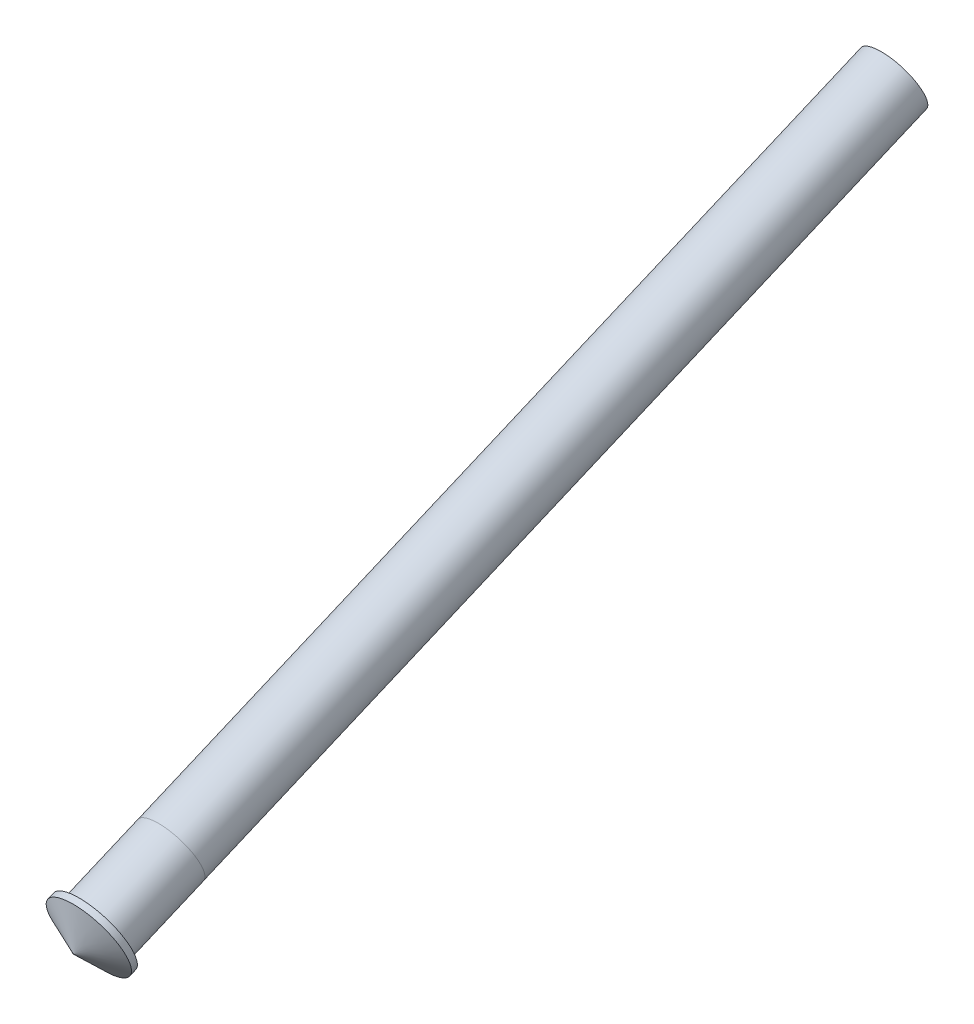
ISO-10303-21;
HEADER;
FILE_DESCRIPTION(('STEP AP214'),'2;1');
FILE_NAME('part.step','',(''),(''),'','','');
FILE_SCHEMA(('AUTOMOTIVE_DESIGN { 1 0 10303 214 1 1 1 1 }'));
ENDSEC;
DATA;
#1=APPLICATION_CONTEXT('core data for automotive mechanical design processes');
#2=APPLICATION_PROTOCOL_DEFINITION('international standard','automotive_design',2000,#1);
#3=PRODUCT_CONTEXT('',#1,'mechanical');
#4=PRODUCT('Part','Part','',(#3));
#5=PRODUCT_RELATED_PRODUCT_CATEGORY('part','',(#4));
#6=PRODUCT_DEFINITION_FORMATION('','',#4);
#7=PRODUCT_DEFINITION_CONTEXT('part definition',#1,'design');
#8=PRODUCT_DEFINITION('design','',#6,#7);
#9=PRODUCT_DEFINITION_SHAPE('','',#8);
#10=(LENGTH_UNIT() NAMED_UNIT(*) SI_UNIT(.MILLI.,.METRE.));
#11=(NAMED_UNIT(*) PLANE_ANGLE_UNIT() SI_UNIT($,.RADIAN.));
#12=(NAMED_UNIT(*) SI_UNIT($,.STERADIAN.) SOLID_ANGLE_UNIT());
#13=UNCERTAINTY_MEASURE_WITH_UNIT(LENGTH_MEASURE(1.E-05),#10,'distance_accuracy_value','');
#14=(GEOMETRIC_REPRESENTATION_CONTEXT(3) GLOBAL_UNCERTAINTY_ASSIGNED_CONTEXT((#13)) GLOBAL_UNIT_ASSIGNED_CONTEXT((#10,
#11,#12)) REPRESENTATION_CONTEXT('',''));
#15=CARTESIAN_POINT('',(0.,0.,0.));
#16=DIRECTION('',(0.,0.,1.));
#17=DIRECTION('',(1.,0.,0.));
#18=AXIS2_PLACEMENT_3D('',#15,#16,#17);
#19=CARTESIAN_POINT('',(0.,19.3504227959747,2.8839953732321));
#20=DIRECTION('',(0.,-0.390731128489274,0.92050485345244));
#21=DIRECTION('',(0.,-0.92050485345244,-0.390731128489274));
#22=AXIS2_PLACEMENT_3D('',#19,#20,#21);
#23=CYLINDRICAL_SURFACE('',#22,6.35);
#24=CARTESIAN_POINT('',(0.,19.3504227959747,2.8839953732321));
#25=DIRECTION('',(0.,-0.390731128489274,0.920504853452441));
#26=DIRECTION('',(-1.,0.,0.));
#27=AXIS2_PLACEMENT_3D('',#24,#25,#26);
#28=CIRCLE('',#27,6.35);
#29=CARTESIAN_POINT('',(-6.35,19.3504227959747,2.8839953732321));
#30=VERTEX_POINT('',#29);
#31=EDGE_CURVE('E45',#30,#30,#28,.T.);
#32=ORIENTED_EDGE('',*,*,#31,.T.);
#33=EDGE_LOOP('',(#32));
#34=FACE_BOUND('',#33,.T.);
#35=CARTESIAN_POINT('',(0.,12.8994518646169,18.0815305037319));
#36=DIRECTION('',(0.,-0.390731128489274,0.920504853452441));
#37=DIRECTION('',(0.,-0.92050485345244,-0.390731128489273));
#38=AXIS2_PLACEMENT_3D('',#35,#36,#37);
#39=CIRCLE('',#38,6.35);
#40=CARTESIAN_POINT('',(0.,7.05424604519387,15.600387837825));
#41=VERTEX_POINT('',#40);
#42=EDGE_CURVE('E41',#41,#41,#39,.F.);
#43=ORIENTED_EDGE('',*,*,#42,.T.);
#44=EDGE_LOOP('',(#43));
#45=FACE_BOUND('',#44,.T.);
#46=ADVANCED_FACE('F37',(#34,#45),#23,.T.);
#47=CARTESIAN_POINT('',(0.,43.2090906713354,-53.3235037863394));
#48=DIRECTION('',(0.,-0.390731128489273,0.92050485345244));
#49=DIRECTION('',(0.,-0.92050485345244,-0.390731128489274));
#50=AXIS2_PLACEMENT_3D('',#47,#48,#49);
#51=CYLINDRICAL_SURFACE('',#50,6.3373);
#52=CARTESIAN_POINT('',(0.,19.3504227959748,2.88399537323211));
#53=DIRECTION('',(0.,-0.390731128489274,0.920504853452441));
#54=DIRECTION('',(0.,-0.92050485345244,-0.390731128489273));
#55=AXIS2_PLACEMENT_3D('',#52,#53,#54);
#56=CIRCLE('',#55,6.3373);
#57=CARTESIAN_POINT('',(0.,13.5169073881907,0.407814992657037));
#58=VERTEX_POINT('',#57);
#59=EDGE_CURVE('E10',#58,#58,#56,.F.);
#60=ORIENTED_EDGE('',*,*,#59,.T.);
#61=EDGE_LOOP('',(#60));
#62=FACE_BOUND('',#61,.T.);
#63=CARTESIAN_POINT('',(0.,80.5686643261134,-141.337143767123));
#64=DIRECTION('',(0.,0.390731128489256,-0.920504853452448));
#65=DIRECTION('',(0.,0.920504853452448,0.390731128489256));
#66=AXIS2_PLACEMENT_3D('',#63,#64,#65);
#67=CIRCLE('',#66,6.33730000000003);
#68=CARTESIAN_POINT('',(0.,86.4021797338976,-138.860963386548));
#69=VERTEX_POINT('',#68);
#70=EDGE_CURVE('E60',#69,#69,#67,.T.);
#71=ORIENTED_EDGE('',*,*,#70,.F.);
#72=EDGE_LOOP('',(#71));
#73=FACE_BOUND('',#72,.T.);
#74=ADVANCED_FACE('F39',(#62,#73),#51,.T.);
#75=CARTESIAN_POINT('',(0.,19.3504227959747,2.8839953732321));
#76=DIRECTION('',(0.,-0.390731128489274,0.920504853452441));
#77=DIRECTION('',(0.,-0.92050485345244,-0.390731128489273));
#78=AXIS2_PLACEMENT_3D('',#75,#76,#77);
#79=PLANE('',#78);
#80=ORIENTED_EDGE('',*,*,#59,.F.);
#81=EDGE_LOOP('',(#80));
#82=FACE_BOUND('',#81,.T.);
#83=ORIENTED_EDGE('',*,*,#31,.F.);
#84=EDGE_LOOP('',(#83));
#85=FACE_BOUND('',#84,.T.);
#86=ADVANCED_FACE('F67',(#82,#85),#79,.F.);
#87=CARTESIAN_POINT('',(0.,12.8994518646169,18.0815305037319));
#88=DIRECTION('',(0.,-0.390731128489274,0.92050485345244));
#89=DIRECTION('',(0.,-0.92050485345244,-0.390731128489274));
#90=AXIS2_PLACEMENT_3D('',#87,#88,#89);
#91=CYLINDRICAL_SURFACE('',#90,7.9375);
#92=CARTESIAN_POINT('',(0.,12.8994518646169,18.0815305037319));
#93=DIRECTION('',(0.,-0.390731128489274,0.920504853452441));
#94=DIRECTION('',(-1.,0.,0.));
#95=AXIS2_PLACEMENT_3D('',#92,#93,#94);
#96=CIRCLE('',#95,7.9375);
#97=CARTESIAN_POINT('',(-7.9375,12.8994518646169,18.0815305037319));
#98=VERTEX_POINT('',#97);
#99=EDGE_CURVE('E51',#98,#98,#96,.T.);
#100=ORIENTED_EDGE('',*,*,#99,.T.);
#101=EDGE_LOOP('',(#100));
#102=FACE_BOUND('',#101,.T.);
#103=CARTESIAN_POINT('',(0.,12.4032233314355,19.2505716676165));
#104=DIRECTION('',(0.,-0.390731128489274,0.920504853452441));
#105=DIRECTION('',(-1.,0.,0.));
#106=AXIS2_PLACEMENT_3D('',#103,#104,#105);
#107=CIRCLE('',#106,7.9375);
#108=CARTESIAN_POINT('',(0.,5.09671605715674,16.1491433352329));
#109=VERTEX_POINT('',#108);
#110=EDGE_CURVE('E54',#109,#109,#107,.T.);
#111=ORIENTED_EDGE('',*,*,#110,.F.);
#112=EDGE_LOOP('',(#111));
#113=FACE_BOUND('',#112,.T.);
#114=ADVANCED_FACE('F73',(#102,#113),#91,.T.);
#115=CARTESIAN_POINT('',(0.,12.8994518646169,18.0815305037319));
#116=DIRECTION('',(0.,-0.390731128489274,0.920504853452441));
#117=DIRECTION('',(0.,-0.92050485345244,-0.390731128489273));
#118=AXIS2_PLACEMENT_3D('',#115,#116,#117);
#119=PLANE('',#118);
#120=ORIENTED_EDGE('',*,*,#42,.F.);
#121=EDGE_LOOP('',(#120));
#122=FACE_BOUND('',#121,.T.);
#123=ORIENTED_EDGE('',*,*,#99,.F.);
#124=EDGE_LOOP('',(#123));
#125=FACE_BOUND('',#124,.T.);
#126=ADVANCED_FACE('F87',(#122,#125),#119,.F.);
#127=CARTESIAN_POINT('',(0.,12.4032233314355,19.2505716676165));
#128=DIRECTION('',(0.,0.390731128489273,-0.92050485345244));
#129=DIRECTION('',(0.,-0.92050485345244,-0.390731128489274));
#130=AXIS2_PLACEMENT_3D('',#127,#128,#129);
#131=CONICAL_SURFACE('',#130,7.9375,1.1693705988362);
#132=CARTESIAN_POINT('',(0.,11.0966696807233,22.3286191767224));
#133=DIRECTION('',(0.,-0.390731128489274,0.920504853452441));
#134=DIRECTION('',(0.,-0.92050485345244,-0.390731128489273));
#135=AXIS2_PLACEMENT_3D('',#132,#133,#134);
#136=CIRCLE('',#135,0.0598386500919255);
#137=CARTESIAN_POINT('',(0.,11.0415879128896,22.3052383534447));
#138=VERTEX_POINT('',#137);
#139=EDGE_CURVE('E57',#138,#138,#136,.T.);
#140=CARTESIAN_POINT('',(0.,11.0415879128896,22.3052383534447));
#141=CARTESIAN_POINT('',(0.,10.9796621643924,22.2411123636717));
#142=CARTESIAN_POINT('',(0.,10.9177364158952,22.1769863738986));
#143=CARTESIAN_POINT('',(0.,10.7938849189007,22.0487343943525));
#144=CARTESIAN_POINT('',(0.,10.7319591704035,21.9846084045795));
#145=CARTESIAN_POINT('',(0.,10.6081076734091,21.8563564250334));
#146=CARTESIAN_POINT('',(0.,10.5461819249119,21.7922304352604));
#147=CARTESIAN_POINT('',(0.,10.4223304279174,21.6639784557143));
#148=CARTESIAN_POINT('',(0.,10.3604046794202,21.5998524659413));
#149=CARTESIAN_POINT('',(0.,10.2365531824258,21.4716004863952));
#150=CARTESIAN_POINT('',(0.,10.1746274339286,21.4074744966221));
#151=CARTESIAN_POINT('',(0.,10.0507759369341,21.2792225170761));
#152=CARTESIAN_POINT('',(0.,9.98885018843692,21.215096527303));
#153=CARTESIAN_POINT('',(0.,9.86499869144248,21.0868445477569));
#154=CARTESIAN_POINT('',(0.,9.80307294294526,21.0227185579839));
#155=CARTESIAN_POINT('',(0.,9.67922144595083,20.8944665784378));
#156=CARTESIAN_POINT('',(0.,9.61729569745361,20.8303405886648));
#157=CARTESIAN_POINT('',(0.,9.49344420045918,20.7020886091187));
#158=CARTESIAN_POINT('',(0.,9.43151845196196,20.6379626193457));
#159=CARTESIAN_POINT('',(0.,9.30766695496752,20.5097106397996));
#160=CARTESIAN_POINT('',(0.,9.24574120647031,20.4455846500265));
#161=CARTESIAN_POINT('',(0.,9.12188970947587,20.3173326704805));
#162=CARTESIAN_POINT('',(0.,9.05996396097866,20.2532066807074));
#163=CARTESIAN_POINT('',(0.,8.93611246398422,20.1249547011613));
#164=CARTESIAN_POINT('',(0.,8.874186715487,20.0608287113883));
#165=CARTESIAN_POINT('',(0.,8.75033521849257,19.9325767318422));
#166=CARTESIAN_POINT('',(0.,8.68840946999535,19.8684507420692));
#167=CARTESIAN_POINT('',(0.,8.56455797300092,19.7401987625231));
#168=CARTESIAN_POINT('',(0.,8.5026322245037,19.6760727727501));
#169=CARTESIAN_POINT('',(0.,8.37878072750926,19.547820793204));
#170=CARTESIAN_POINT('',(0.,8.31685497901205,19.483694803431));
#171=CARTESIAN_POINT('',(0.,8.19300348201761,19.3554428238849));
#172=CARTESIAN_POINT('',(0.,8.13107773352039,19.2913168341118));
#173=CARTESIAN_POINT('',(0.,8.00722623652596,19.1630648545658));
#174=CARTESIAN_POINT('',(0.,7.94530048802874,19.0989388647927));
#175=CARTESIAN_POINT('',(0.,7.82144899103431,18.9706868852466));
#176=CARTESIAN_POINT('',(0.,7.75952324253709,18.9065608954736));
#177=CARTESIAN_POINT('',(0.,7.63567174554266,18.7783089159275));
#178=CARTESIAN_POINT('',(0.,7.57374599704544,18.7141829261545));
#179=CARTESIAN_POINT('',(0.,7.449894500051,18.5859309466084));
#180=CARTESIAN_POINT('',(0.,7.38796875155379,18.5218049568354));
#181=CARTESIAN_POINT('',(0.,7.26411725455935,18.3935529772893));
#182=CARTESIAN_POINT('',(0.,7.20219150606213,18.3294269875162));
#183=CARTESIAN_POINT('',(0.,7.0783400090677,18.2011750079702));
#184=CARTESIAN_POINT('',(0.,7.01641426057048,18.1370490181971));
#185=CARTESIAN_POINT('',(0.,6.89256276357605,18.008797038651));
#186=CARTESIAN_POINT('',(0.,6.83063701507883,17.944671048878));
#187=CARTESIAN_POINT('',(0.,6.70678551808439,17.8164190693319));
#188=CARTESIAN_POINT('',(0.,6.64485976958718,17.7522930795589));
#189=CARTESIAN_POINT('',(0.,6.52100827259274,17.6240411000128));
#190=CARTESIAN_POINT('',(0.,6.45908252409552,17.5599151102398));
#191=CARTESIAN_POINT('',(0.,6.33523102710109,17.4316631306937));
#192=CARTESIAN_POINT('',(0.,6.27330527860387,17.3675371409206));
#193=CARTESIAN_POINT('',(0.,6.14945378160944,17.2392851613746));
#194=CARTESIAN_POINT('',(0.,6.08752803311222,17.1751591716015));
#195=CARTESIAN_POINT('',(0.,5.96367653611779,17.0469071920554));
#196=CARTESIAN_POINT('',(0.,5.90175078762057,16.9827812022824));
#197=CARTESIAN_POINT('',(0.,5.77789929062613,16.8545292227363));
#198=CARTESIAN_POINT('',(0.,5.71597354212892,16.7904032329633));
#199=CARTESIAN_POINT('',(0.,5.59212204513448,16.6621512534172));
#200=CARTESIAN_POINT('',(0.,5.53019629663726,16.5980252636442));
#201=CARTESIAN_POINT('',(0.,5.40634479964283,16.4697732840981));
#202=CARTESIAN_POINT('',(0.,5.34441905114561,16.4056472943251));
#203=CARTESIAN_POINT('',(0.,5.22056755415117,16.277395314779));
#204=CARTESIAN_POINT('',(0.,5.15864180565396,16.2132693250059));
#205=CARTESIAN_POINT('',(0.,5.09671605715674,16.1491433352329));
#206=B_SPLINE_CURVE_WITH_KNOTS('',3,(#140,#141,#142,#143,#144,#145,#146,#147,#148,#149,#150,
#151,#152,#153,#154,#155,#156,#157,#158,#159,#160,#161,#162,#163,#164,#165,#166,#167,#168,#169,
#170,#171,#172,#173,#174,#175,#176,#177,#178,#179,#180,#181,#182,#183,#184,#185,#186,#187,#188,
#189,#190,#191,#192,#193,#194,#195,#196,#197,#198,#199,#200,#201,#202,#203,#204,#205),
.UNSPECIFIED.,.F.,.F.,(4,2,2,2,2,2,2,2,2,2,2,2,2,2,2,2,2,2,2,2,2,2,2,2,2,2,2,2,2,2,2,2,4),(0.,
0.267436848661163,0.534873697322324,0.802310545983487,1.06974739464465,1.33718424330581,
1.60462109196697,1.87205794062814,2.1394947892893,2.40693163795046,2.67436848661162,
2.94180533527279,3.20924218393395,3.47667903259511,3.74411588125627,4.01155272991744,
4.2789895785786,4.54642642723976,4.81386327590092,5.08130012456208,5.34873697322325,
5.61617382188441,5.88361067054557,6.15104751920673,6.41848436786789,6.68592121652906,
6.95335806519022,7.22079491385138,7.48823176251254,7.7556686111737,8.02310545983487,
8.29054230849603,8.55797915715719),.UNSPECIFIED.);
#207=EDGE_CURVE('BSEAM90',#138,#109,#206,.T.);
#208=ORIENTED_EDGE('',*,*,#139,.F.);
#209=ORIENTED_EDGE('',*,*,#110,.T.);
#210=ORIENTED_EDGE('',*,*,#207,.T.);
#211=ORIENTED_EDGE('',*,*,#207,.F.);
#212=EDGE_LOOP('',(#208,#210,#209,#211));
#213=FACE_BOUND('',#212,.T.);
#214=ADVANCED_FACE('F90',(#213),#131,.T.);
#215=CARTESIAN_POINT('',(0.,11.0966696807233,22.3286191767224));
#216=DIRECTION('',(0.,-0.390731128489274,0.920504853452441));
#217=DIRECTION('',(0.,-0.92050485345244,-0.390731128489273));
#218=AXIS2_PLACEMENT_3D('',#215,#216,#217);
#219=PLANE('',#218);
#220=ORIENTED_EDGE('',*,*,#139,.T.);
#221=EDGE_LOOP('',(#220));
#222=FACE_BOUND('',#221,.T.);
#223=ADVANCED_FACE('F94',(#222),#219,.T.);
#224=CARTESIAN_POINT('',(0.,86.4021797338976,-138.860963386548));
#225=DIRECTION('',(0.,0.390731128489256,-0.920504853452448));
#226=DIRECTION('',(0.,0.920504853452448,0.390731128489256));
#227=AXIS2_PLACEMENT_3D('',#224,#225,#226);
#228=PLANE('',#227);
#229=ORIENTED_EDGE('',*,*,#70,.T.);
#230=EDGE_LOOP('',(#229));
#231=FACE_BOUND('',#230,.T.);
#232=ADVANCED_FACE('F64',(#231),#228,.T.);
#233=CLOSED_SHELL('',(#46,#74,#86,#114,#126,#214,#223,#232));
#234=MANIFOLD_SOLID_BREP('B2',#233);
#235=ADVANCED_BREP_SHAPE_REPRESENTATION('',(#18,#234),#14);
#236=SHAPE_DEFINITION_REPRESENTATION(#9,#235);
ENDSEC;
END-ISO-10303-21;
